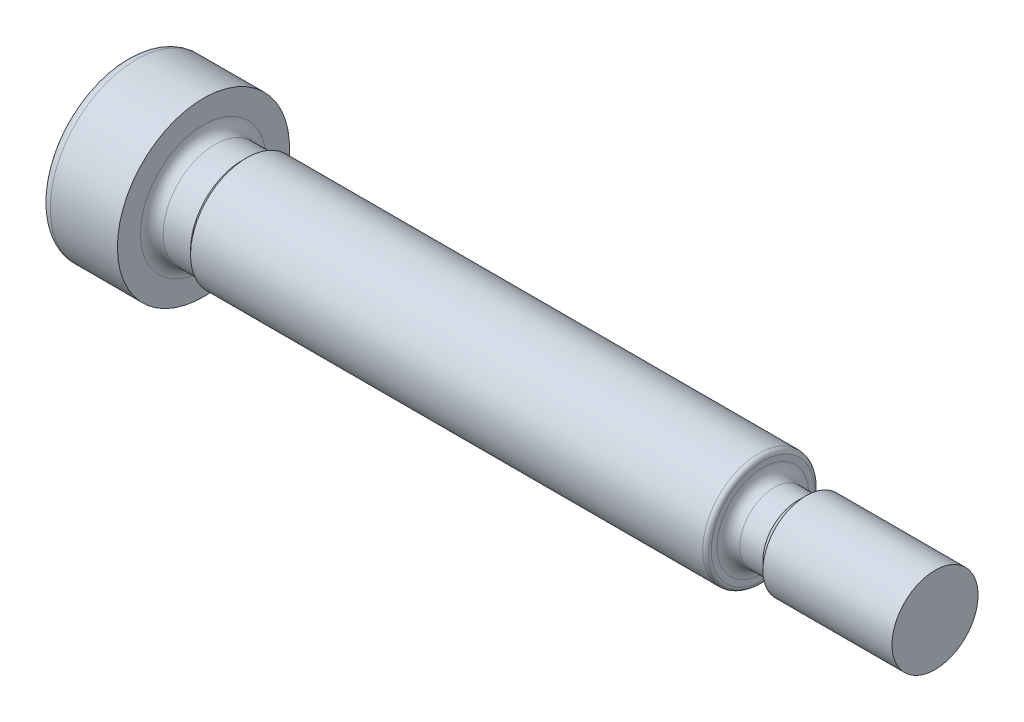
ISO-10303-21;
HEADER;
FILE_DESCRIPTION(('STEP AP214'),'2;1');
FILE_NAME('part.step','',(''),(''),'','','');
FILE_SCHEMA(('AUTOMOTIVE_DESIGN { 1 0 10303 214 1 1 1 1 }'));
ENDSEC;
DATA;
#1=APPLICATION_CONTEXT('core data for automotive mechanical design processes');
#2=APPLICATION_PROTOCOL_DEFINITION('international standard','automotive_design',2000,#1);
#3=PRODUCT_CONTEXT('',#1,'mechanical');
#4=PRODUCT('Part','Part','',(#3));
#5=PRODUCT_RELATED_PRODUCT_CATEGORY('part','',(#4));
#6=PRODUCT_DEFINITION_FORMATION('','',#4);
#7=PRODUCT_DEFINITION_CONTEXT('part definition',#1,'design');
#8=PRODUCT_DEFINITION('design','',#6,#7);
#9=PRODUCT_DEFINITION_SHAPE('','',#8);
#10=(LENGTH_UNIT() NAMED_UNIT(*) SI_UNIT(.MILLI.,.METRE.));
#11=(NAMED_UNIT(*) PLANE_ANGLE_UNIT() SI_UNIT($,.RADIAN.));
#12=(NAMED_UNIT(*) SI_UNIT($,.STERADIAN.) SOLID_ANGLE_UNIT());
#13=UNCERTAINTY_MEASURE_WITH_UNIT(LENGTH_MEASURE(1.E-05),#10,'distance_accuracy_value','');
#14=(GEOMETRIC_REPRESENTATION_CONTEXT(3) GLOBAL_UNCERTAINTY_ASSIGNED_CONTEXT((#13)) GLOBAL_UNIT_ASSIGNED_CONTEXT((#10,
#11,#12)) REPRESENTATION_CONTEXT('',''));
#15=CARTESIAN_POINT('',(0.,0.,0.));
#16=DIRECTION('',(0.,0.,1.));
#17=DIRECTION('',(1.,0.,0.));
#18=AXIS2_PLACEMENT_3D('',#15,#16,#17);
#19=CARTESIAN_POINT('',(0.,0.,0.));
#20=DIRECTION('',(1.,0.,0.));
#21=DIRECTION('',(0.,0.,-1.));
#22=AXIS2_PLACEMENT_3D('',#19,#20,#21);
#23=PLANE('',#22);
#24=DIRECTION('',(0.,-0.866025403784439,0.5));
#25=VECTOR('',#24,1.);
#26=CARTESIAN_POINT('',(0.,0.,-1.73205080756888));
#27=LINE('',#26,#25);
#28=CARTESIAN_POINT('',(0.,0.,-1.73205080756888));
#29=VERTEX_POINT('',#28);
#30=CARTESIAN_POINT('',(0.,-1.5,-0.86602540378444));
#31=VERTEX_POINT('',#30);
#32=EDGE_CURVE('E136',#29,#31,#27,.T.);
#33=ORIENTED_EDGE('',*,*,#32,.F.);
#34=DIRECTION('',(0.,-0.866025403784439,-0.5));
#35=VECTOR('',#34,1.);
#36=CARTESIAN_POINT('',(0.,1.5,-0.866025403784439));
#37=LINE('',#36,#35);
#38=CARTESIAN_POINT('',(0.,1.5,-0.866025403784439));
#39=VERTEX_POINT('',#38);
#40=EDGE_CURVE('E62',#39,#29,#37,.T.);
#41=ORIENTED_EDGE('',*,*,#40,.F.);
#42=DIRECTION('',(0.,0.,-1.));
#43=VECTOR('',#42,1.);
#44=CARTESIAN_POINT('',(0.,1.5,0.866025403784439));
#45=LINE('',#44,#43);
#46=CARTESIAN_POINT('',(0.,1.5,0.866025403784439));
#47=VERTEX_POINT('',#46);
#48=EDGE_CURVE('E145',#47,#39,#45,.T.);
#49=ORIENTED_EDGE('',*,*,#48,.F.);
#50=DIRECTION('',(0.,0.866025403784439,-0.5));
#51=VECTOR('',#50,1.);
#52=CARTESIAN_POINT('',(0.,0.,1.73205080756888));
#53=LINE('',#52,#51);
#54=CARTESIAN_POINT('',(0.,0.,1.73205080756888));
#55=VERTEX_POINT('',#54);
#56=EDGE_CURVE('E143',#55,#47,#53,.T.);
#57=ORIENTED_EDGE('',*,*,#56,.F.);
#58=DIRECTION('',(0.,0.866025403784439,0.5));
#59=VECTOR('',#58,1.);
#60=CARTESIAN_POINT('',(0.,-1.5,0.866025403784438));
#61=LINE('',#60,#59);
#62=CARTESIAN_POINT('',(0.,-1.5,0.866025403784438));
#63=VERTEX_POINT('',#62);
#64=EDGE_CURVE('E110',#63,#55,#61,.T.);
#65=ORIENTED_EDGE('',*,*,#64,.F.);
#66=DIRECTION('',(0.,0.,1.));
#67=VECTOR('',#66,1.);
#68=CARTESIAN_POINT('',(0.,-1.5,-0.86602540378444));
#69=LINE('',#68,#67);
#70=EDGE_CURVE('E139',#31,#63,#69,.T.);
#71=ORIENTED_EDGE('',*,*,#70,.F.);
#72=EDGE_LOOP('',(#33,#41,#49,#57,#65,#71));
#73=FACE_BOUND('',#72,.T.);
#74=CARTESIAN_POINT('',(0.,0.,0.));
#75=DIRECTION('',(1.,0.,0.));
#76=DIRECTION('',(0.,0.,-1.));
#77=AXIS2_PLACEMENT_3D('',#74,#75,#76);
#78=CIRCLE('',#77,4.4);
#79=CARTESIAN_POINT('',(0.,0.,-4.4));
#80=VERTEX_POINT('',#79);
#81=EDGE_CURVE('E184',#80,#80,#78,.F.);
#82=ORIENTED_EDGE('',*,*,#81,.T.);
#83=EDGE_LOOP('',(#82));
#84=FACE_BOUND('',#83,.T.);
#85=ADVANCED_FACE('F47',(#73,#84),#23,.F.);
#86=CARTESIAN_POINT('',(0.,0.,0.));
#87=DIRECTION('',(-1.,0.,0.));
#88=DIRECTION('',(0.,0.,1.));
#89=AXIS2_PLACEMENT_3D('',#86,#87,#88);
#90=CYLINDRICAL_SURFACE('',#89,5.);
#91=CARTESIAN_POINT('',(0.6,0.,0.));
#92=DIRECTION('',(1.,0.,0.));
#93=DIRECTION('',(0.,0.,-1.));
#94=AXIS2_PLACEMENT_3D('',#91,#92,#93);
#95=CIRCLE('',#94,5.);
#96=CARTESIAN_POINT('',(0.6,0.,-5.));
#97=VERTEX_POINT('',#96);
#98=EDGE_CURVE('E187',#97,#97,#95,.T.);
#99=ORIENTED_EDGE('',*,*,#98,.T.);
#100=EDGE_LOOP('',(#99));
#101=FACE_BOUND('',#100,.T.);
#102=CARTESIAN_POINT('',(4.5,0.,0.));
#103=DIRECTION('',(-1.,0.,0.));
#104=DIRECTION('',(0.,0.,1.));
#105=AXIS2_PLACEMENT_3D('',#102,#103,#104);
#106=CIRCLE('',#105,5.);
#107=CARTESIAN_POINT('',(4.5,0.,5.));
#108=VERTEX_POINT('',#107);
#109=EDGE_CURVE('E169',#108,#108,#106,.T.);
#110=ORIENTED_EDGE('',*,*,#109,.T.);
#111=EDGE_LOOP('',(#110));
#112=FACE_BOUND('',#111,.T.);
#113=ADVANCED_FACE('F204',(#101,#112),#90,.T.);
#114=CARTESIAN_POINT('',(4.5,5.,0.));
#115=DIRECTION('',(-1.,0.,0.));
#116=DIRECTION('',(0.,0.,1.));
#117=AXIS2_PLACEMENT_3D('',#114,#115,#116);
#118=PLANE('',#117);
#119=CARTESIAN_POINT('',(4.5,0.,0.));
#120=DIRECTION('',(-1.,0.,0.));
#121=DIRECTION('',(0.,0.,1.));
#122=AXIS2_PLACEMENT_3D('',#119,#120,#121);
#123=CIRCLE('',#122,3.66);
#124=CARTESIAN_POINT('',(4.5,0.,3.66));
#125=VERTEX_POINT('',#124);
#126=EDGE_CURVE('E172',#125,#125,#123,.T.);
#127=ORIENTED_EDGE('',*,*,#126,.T.);
#128=EDGE_LOOP('',(#127));
#129=FACE_BOUND('',#128,.T.);
#130=ORIENTED_EDGE('',*,*,#109,.F.);
#131=EDGE_LOOP('',(#130));
#132=FACE_BOUND('',#131,.T.);
#133=ADVANCED_FACE('F210',(#129,#132),#118,.F.);
#134=CARTESIAN_POINT('',(0.,0.,0.));
#135=DIRECTION('',(-1.,0.,0.));
#136=DIRECTION('',(0.,0.,1.));
#137=AXIS2_PLACEMENT_3D('',#134,#135,#136);
#138=CYLINDRICAL_SURFACE('',#137,3.);
#139=CARTESIAN_POINT('',(5.16,0.,0.));
#140=DIRECTION('',(-1.,0.,0.));
#141=DIRECTION('',(0.,0.,1.));
#142=AXIS2_PLACEMENT_3D('',#139,#140,#141);
#143=CIRCLE('',#142,3.);
#144=CARTESIAN_POINT('',(5.16,0.,3.));
#145=VERTEX_POINT('',#144);
#146=EDGE_CURVE('E175',#145,#145,#143,.F.);
#147=ORIENTED_EDGE('',*,*,#146,.T.);
#148=EDGE_LOOP('',(#147));
#149=FACE_BOUND('',#148,.T.);
#150=CARTESIAN_POINT('',(6.75,0.,0.));
#151=DIRECTION('',(-1.,0.,0.));
#152=DIRECTION('',(0.,0.,1.));
#153=AXIS2_PLACEMENT_3D('',#150,#151,#152);
#154=CIRCLE('',#153,3.);
#155=CARTESIAN_POINT('',(6.75,0.,3.));
#156=VERTEX_POINT('',#155);
#157=EDGE_CURVE('E166',#156,#156,#154,.T.);
#158=ORIENTED_EDGE('',*,*,#157,.T.);
#159=EDGE_LOOP('',(#158));
#160=FACE_BOUND('',#159,.T.);
#161=ADVANCED_FACE('F241',(#149,#160),#138,.T.);
#162=CARTESIAN_POINT('',(7.,0.,0.));
#163=DIRECTION('',(1.,0.,0.));
#164=DIRECTION('',(0.,0.,-1.));
#165=AXIS2_PLACEMENT_3D('',#162,#163,#164);
#166=CONICAL_SURFACE('',#165,3.25,0.785398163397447);
#167=ORIENTED_EDGE('',*,*,#157,.F.);
#168=EDGE_LOOP('',(#167));
#169=FACE_BOUND('',#168,.T.);
#170=CARTESIAN_POINT('',(7.,0.,0.));
#171=DIRECTION('',(-1.,0.,0.));
#172=DIRECTION('',(0.,0.,1.));
#173=AXIS2_PLACEMENT_3D('',#170,#171,#172);
#174=CIRCLE('',#173,3.25);
#175=CARTESIAN_POINT('',(7.,0.,3.25));
#176=VERTEX_POINT('',#175);
#177=EDGE_CURVE('E163',#176,#176,#174,.T.);
#178=ORIENTED_EDGE('',*,*,#177,.T.);
#179=EDGE_LOOP('',(#178));
#180=FACE_BOUND('',#179,.T.);
#181=ADVANCED_FACE('F246',(#169,#180),#166,.T.);
#182=CARTESIAN_POINT('',(0.,0.,0.));
#183=DIRECTION('',(-1.,0.,0.));
#184=DIRECTION('',(0.,0.,1.));
#185=AXIS2_PLACEMENT_3D('',#182,#183,#184);
#186=CYLINDRICAL_SURFACE('',#185,3.25);
#187=CARTESIAN_POINT('',(36.75,0.,0.));
#188=DIRECTION('',(-1.,0.,0.));
#189=DIRECTION('',(0.,0.,1.));
#190=AXIS2_PLACEMENT_3D('',#187,#188,#189);
#191=CIRCLE('',#190,3.25);
#192=CARTESIAN_POINT('',(36.75,0.,3.25));
#193=VERTEX_POINT('',#192);
#194=EDGE_CURVE('E55',#193,#193,#191,.T.);
#195=ORIENTED_EDGE('',*,*,#194,.T.);
#196=EDGE_LOOP('',(#195));
#197=FACE_BOUND('',#196,.T.);
#198=ORIENTED_EDGE('',*,*,#177,.F.);
#199=EDGE_LOOP('',(#198));
#200=FACE_BOUND('',#199,.T.);
#201=ADVANCED_FACE('F192',(#197,#200),#186,.T.);
#202=CARTESIAN_POINT('',(37.,3.25,0.));
#203=DIRECTION('',(-1.,0.,0.));
#204=DIRECTION('',(0.,0.,1.));
#205=AXIS2_PLACEMENT_3D('',#202,#203,#204);
#206=PLANE('',#205);
#207=CARTESIAN_POINT('',(37.,0.,0.));
#208=DIRECTION('',(-1.,0.,0.));
#209=DIRECTION('',(0.,0.,1.));
#210=AXIS2_PLACEMENT_3D('',#207,#208,#209);
#211=CIRCLE('',#210,3.);
#212=CARTESIAN_POINT('',(37.,0.,3.));
#213=VERTEX_POINT('',#212);
#214=EDGE_CURVE('E13',#213,#213,#211,.F.);
#215=ORIENTED_EDGE('',*,*,#214,.T.);
#216=EDGE_LOOP('',(#215));
#217=FACE_BOUND('',#216,.T.);
#218=CARTESIAN_POINT('',(37.,0.,0.));
#219=DIRECTION('',(-1.,0.,0.));
#220=DIRECTION('',(0.,0.,1.));
#221=AXIS2_PLACEMENT_3D('',#218,#219,#220);
#222=CIRCLE('',#221,2.66);
#223=CARTESIAN_POINT('',(37.,0.,2.66));
#224=VERTEX_POINT('',#223);
#225=EDGE_CURVE('E178',#224,#224,#222,.T.);
#226=ORIENTED_EDGE('',*,*,#225,.T.);
#227=EDGE_LOOP('',(#226));
#228=FACE_BOUND('',#227,.T.);
#229=ADVANCED_FACE('F255',(#217,#228),#206,.F.);
#230=CARTESIAN_POINT('',(0.,0.,0.));
#231=DIRECTION('',(-1.,0.,0.));
#232=DIRECTION('',(0.,0.,1.));
#233=AXIS2_PLACEMENT_3D('',#230,#231,#232);
#234=CYLINDRICAL_SURFACE('',#233,2.);
#235=CARTESIAN_POINT('',(37.66,0.,0.));
#236=DIRECTION('',(-1.,0.,0.));
#237=DIRECTION('',(0.,0.,1.));
#238=AXIS2_PLACEMENT_3D('',#235,#236,#237);
#239=CIRCLE('',#238,2.);
#240=CARTESIAN_POINT('',(37.66,0.,2.));
#241=VERTEX_POINT('',#240);
#242=EDGE_CURVE('E181',#241,#241,#239,.F.);
#243=ORIENTED_EDGE('',*,*,#242,.T.);
#244=EDGE_LOOP('',(#243));
#245=FACE_BOUND('',#244,.T.);
#246=CARTESIAN_POINT('',(39.,0.,0.));
#247=DIRECTION('',(-1.,0.,0.));
#248=DIRECTION('',(0.,0.,1.));
#249=AXIS2_PLACEMENT_3D('',#246,#247,#248);
#250=CIRCLE('',#249,2.);
#251=CARTESIAN_POINT('',(39.,0.,2.));
#252=VERTEX_POINT('',#251);
#253=EDGE_CURVE('E160',#252,#252,#250,.T.);
#254=ORIENTED_EDGE('',*,*,#253,.T.);
#255=EDGE_LOOP('',(#254));
#256=FACE_BOUND('',#255,.T.);
#257=ADVANCED_FACE('F258',(#245,#256),#234,.T.);
#258=CARTESIAN_POINT('',(39.5,0.,0.));
#259=DIRECTION('',(1.,0.,0.));
#260=DIRECTION('',(0.,0.,-1.));
#261=AXIS2_PLACEMENT_3D('',#258,#259,#260);
#262=CONICAL_SURFACE('',#261,2.5,0.785398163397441);
#263=ORIENTED_EDGE('',*,*,#253,.F.);
#264=EDGE_LOOP('',(#263));
#265=FACE_BOUND('',#264,.T.);
#266=CARTESIAN_POINT('',(39.5,0.,0.));
#267=DIRECTION('',(-1.,0.,0.));
#268=DIRECTION('',(0.,0.,1.));
#269=AXIS2_PLACEMENT_3D('',#266,#267,#268);
#270=CIRCLE('',#269,2.5);
#271=CARTESIAN_POINT('',(39.5,0.,2.5));
#272=VERTEX_POINT('',#271);
#273=EDGE_CURVE('E157',#272,#272,#270,.T.);
#274=ORIENTED_EDGE('',*,*,#273,.T.);
#275=EDGE_LOOP('',(#274));
#276=FACE_BOUND('',#275,.T.);
#277=ADVANCED_FACE('F262',(#265,#276),#262,.T.);
#278=CARTESIAN_POINT('',(0.,0.,0.));
#279=DIRECTION('',(-1.,0.,0.));
#280=DIRECTION('',(0.,0.,1.));
#281=AXIS2_PLACEMENT_3D('',#278,#279,#280);
#282=CYLINDRICAL_SURFACE('',#281,2.5);
#283=ORIENTED_EDGE('',*,*,#273,.F.);
#284=EDGE_LOOP('',(#283));
#285=FACE_BOUND('',#284,.T.);
#286=CARTESIAN_POINT('',(47.,0.,0.));
#287=DIRECTION('',(-1.,0.,0.));
#288=DIRECTION('',(0.,0.,1.));
#289=AXIS2_PLACEMENT_3D('',#286,#287,#288);
#290=CIRCLE('',#289,2.5);
#291=CARTESIAN_POINT('',(47.,0.,2.5));
#292=VERTEX_POINT('',#291);
#293=EDGE_CURVE('E149',#292,#292,#290,.T.);
#294=ORIENTED_EDGE('',*,*,#293,.T.);
#295=EDGE_LOOP('',(#294));
#296=FACE_BOUND('',#295,.T.);
#297=ADVANCED_FACE('F266',(#285,#296),#282,.T.);
#298=CARTESIAN_POINT('',(47.,2.5,0.));
#299=DIRECTION('',(-1.,0.,0.));
#300=DIRECTION('',(0.,0.,1.));
#301=AXIS2_PLACEMENT_3D('',#298,#299,#300);
#302=PLANE('',#301);
#303=ORIENTED_EDGE('',*,*,#293,.F.);
#304=EDGE_LOOP('',(#303));
#305=FACE_BOUND('',#304,.T.);
#306=ADVANCED_FACE('F221',(#305),#302,.F.);
#307=CARTESIAN_POINT('',(5.16,0.,0.));
#308=DIRECTION('',(-1.,0.,0.));
#309=DIRECTION('',(0.,0.,1.));
#310=AXIS2_PLACEMENT_3D('',#307,#308,#309);
#311=TOROIDAL_SURFACE('',#310,3.66,0.66);
#312=ORIENTED_EDGE('',*,*,#146,.F.);
#313=EDGE_LOOP('',(#312));
#314=FACE_BOUND('',#313,.T.);
#315=ORIENTED_EDGE('',*,*,#126,.F.);
#316=EDGE_LOOP('',(#315));
#317=FACE_BOUND('',#316,.T.);
#318=ADVANCED_FACE('F217',(#314,#317),#311,.F.);
#319=CARTESIAN_POINT('',(37.66,0.,0.));
#320=DIRECTION('',(-1.,0.,0.));
#321=DIRECTION('',(0.,0.,1.));
#322=AXIS2_PLACEMENT_3D('',#319,#320,#321);
#323=TOROIDAL_SURFACE('',#322,2.66,0.66);
#324=ORIENTED_EDGE('',*,*,#242,.F.);
#325=EDGE_LOOP('',(#324));
#326=FACE_BOUND('',#325,.T.);
#327=ORIENTED_EDGE('',*,*,#225,.F.);
#328=EDGE_LOOP('',(#327));
#329=FACE_BOUND('',#328,.T.);
#330=ADVANCED_FACE('F220',(#326,#329),#323,.F.);
#331=CARTESIAN_POINT('',(0.6,0.,0.));
#332=DIRECTION('',(1.,0.,0.));
#333=DIRECTION('',(0.,0.,-1.));
#334=AXIS2_PLACEMENT_3D('',#331,#332,#333);
#335=TOROIDAL_SURFACE('',#334,4.4,0.6);
#336=ORIENTED_EDGE('',*,*,#98,.F.);
#337=EDGE_LOOP('',(#336));
#338=FACE_BOUND('',#337,.T.);
#339=ORIENTED_EDGE('',*,*,#81,.F.);
#340=EDGE_LOOP('',(#339));
#341=FACE_BOUND('',#340,.T.);
#342=ADVANCED_FACE('F224',(#338,#341),#335,.T.);
#343=CARTESIAN_POINT('',(3.5,1.5,-0.866025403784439));
#344=DIRECTION('',(0.,0.5,-0.866025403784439));
#345=DIRECTION('',(0.,0.866025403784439,0.5));
#346=AXIS2_PLACEMENT_3D('',#343,#344,#345);
#347=PLANE('',#346);
#348=ORIENTED_EDGE('',*,*,#40,.T.);
#349=DIRECTION('',(-1.,0.,0.));
#350=VECTOR('',#349,1.);
#351=CARTESIAN_POINT('',(3.5,0.,-1.73205080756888));
#352=LINE('',#351,#350);
#353=CARTESIAN_POINT('',(3.5,0.,-1.73205080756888));
#354=VERTEX_POINT('',#353);
#355=EDGE_CURVE('E92',#354,#29,#352,.T.);
#356=ORIENTED_EDGE('',*,*,#355,.F.);
#357=DIRECTION('',(0.,-0.866025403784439,-0.5));
#358=VECTOR('',#357,1.);
#359=CARTESIAN_POINT('',(3.5,1.5,-0.866025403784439));
#360=LINE('',#359,#358);
#361=CARTESIAN_POINT('',(3.5,1.5,-0.866025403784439));
#362=VERTEX_POINT('',#361);
#363=EDGE_CURVE('E147',#362,#354,#360,.T.);
#364=ORIENTED_EDGE('',*,*,#363,.F.);
#365=DIRECTION('',(-1.,0.,0.));
#366=VECTOR('',#365,1.);
#367=CARTESIAN_POINT('',(3.5,1.5,-0.866025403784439));
#368=LINE('',#367,#366);
#369=EDGE_CURVE('E70',#362,#39,#368,.T.);
#370=ORIENTED_EDGE('',*,*,#369,.T.);
#371=EDGE_LOOP('',(#348,#356,#364,#370));
#372=FACE_BOUND('',#371,.T.);
#373=ADVANCED_FACE('F227',(#372),#347,.F.);
#374=CARTESIAN_POINT('',(3.5,1.5,0.866025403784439));
#375=DIRECTION('',(0.,1.,0.));
#376=DIRECTION('',(0.,0.,1.));
#377=AXIS2_PLACEMENT_3D('',#374,#375,#376);
#378=PLANE('',#377);
#379=ORIENTED_EDGE('',*,*,#48,.T.);
#380=ORIENTED_EDGE('',*,*,#369,.F.);
#381=DIRECTION('',(0.,0.,-1.));
#382=VECTOR('',#381,1.);
#383=CARTESIAN_POINT('',(3.5,1.5,0.866025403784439));
#384=LINE('',#383,#382);
#385=CARTESIAN_POINT('',(3.5,1.5,0.866025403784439));
#386=VERTEX_POINT('',#385);
#387=EDGE_CURVE('E122',#386,#362,#384,.T.);
#388=ORIENTED_EDGE('',*,*,#387,.F.);
#389=DIRECTION('',(-1.,0.,0.));
#390=VECTOR('',#389,1.);
#391=CARTESIAN_POINT('',(3.5,1.5,0.866025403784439));
#392=LINE('',#391,#390);
#393=EDGE_CURVE('E114',#386,#47,#392,.T.);
#394=ORIENTED_EDGE('',*,*,#393,.T.);
#395=EDGE_LOOP('',(#379,#380,#388,#394));
#396=FACE_BOUND('',#395,.T.);
#397=ADVANCED_FACE('F232',(#396),#378,.F.);
#398=CARTESIAN_POINT('',(3.5,0.,1.73205080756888));
#399=DIRECTION('',(0.,0.5,0.866025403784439));
#400=DIRECTION('',(0.,-0.866025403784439,0.5));
#401=AXIS2_PLACEMENT_3D('',#398,#399,#400);
#402=PLANE('',#401);
#403=ORIENTED_EDGE('',*,*,#56,.T.);
#404=ORIENTED_EDGE('',*,*,#393,.F.);
#405=DIRECTION('',(0.,0.866025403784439,-0.5));
#406=VECTOR('',#405,1.);
#407=CARTESIAN_POINT('',(3.5,0.,1.73205080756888));
#408=LINE('',#407,#406);
#409=CARTESIAN_POINT('',(3.5,0.,1.73205080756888));
#410=VERTEX_POINT('',#409);
#411=EDGE_CURVE('E118',#410,#386,#408,.T.);
#412=ORIENTED_EDGE('',*,*,#411,.F.);
#413=DIRECTION('',(-1.,0.,0.));
#414=VECTOR('',#413,1.);
#415=CARTESIAN_POINT('',(3.5,0.,1.73205080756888));
#416=LINE('',#415,#414);
#417=EDGE_CURVE('E103',#410,#55,#416,.T.);
#418=ORIENTED_EDGE('',*,*,#417,.T.);
#419=EDGE_LOOP('',(#403,#404,#412,#418));
#420=FACE_BOUND('',#419,.T.);
#421=ADVANCED_FACE('F119',(#420),#402,.F.);
#422=CARTESIAN_POINT('',(3.5,-1.5,0.866025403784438));
#423=DIRECTION('',(0.,-0.5,0.866025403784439));
#424=DIRECTION('',(0.,-0.866025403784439,-0.5));
#425=AXIS2_PLACEMENT_3D('',#422,#423,#424);
#426=PLANE('',#425);
#427=ORIENTED_EDGE('',*,*,#64,.T.);
#428=ORIENTED_EDGE('',*,*,#417,.F.);
#429=DIRECTION('',(0.,0.866025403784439,0.5));
#430=VECTOR('',#429,1.);
#431=CARTESIAN_POINT('',(3.5,-1.5,0.866025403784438));
#432=LINE('',#431,#430);
#433=CARTESIAN_POINT('',(3.5,-1.5,0.866025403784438));
#434=VERTEX_POINT('',#433);
#435=EDGE_CURVE('E107',#434,#410,#432,.T.);
#436=ORIENTED_EDGE('',*,*,#435,.F.);
#437=DIRECTION('',(-1.,0.,0.));
#438=VECTOR('',#437,1.);
#439=CARTESIAN_POINT('',(3.5,-1.5,0.866025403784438));
#440=LINE('',#439,#438);
#441=EDGE_CURVE('E115',#434,#63,#440,.T.);
#442=ORIENTED_EDGE('',*,*,#441,.T.);
#443=EDGE_LOOP('',(#427,#428,#436,#442));
#444=FACE_BOUND('',#443,.T.);
#445=ADVANCED_FACE('F105',(#444),#426,.F.);
#446=CARTESIAN_POINT('',(3.5,-1.5,-0.86602540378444));
#447=DIRECTION('',(0.,-1.,0.));
#448=DIRECTION('',(0.,0.,-1.));
#449=AXIS2_PLACEMENT_3D('',#446,#447,#448);
#450=PLANE('',#449);
#451=ORIENTED_EDGE('',*,*,#70,.T.);
#452=ORIENTED_EDGE('',*,*,#441,.F.);
#453=DIRECTION('',(0.,0.,1.));
#454=VECTOR('',#453,1.);
#455=CARTESIAN_POINT('',(3.5,-1.5,-0.86602540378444));
#456=LINE('',#455,#454);
#457=CARTESIAN_POINT('',(3.5,-1.5,-0.86602540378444));
#458=VERTEX_POINT('',#457);
#459=EDGE_CURVE('E128',#458,#434,#456,.T.);
#460=ORIENTED_EDGE('',*,*,#459,.F.);
#461=DIRECTION('',(-1.,0.,0.));
#462=VECTOR('',#461,1.);
#463=CARTESIAN_POINT('',(3.5,-1.5,-0.86602540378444));
#464=LINE('',#463,#462);
#465=EDGE_CURVE('E152',#458,#31,#464,.T.);
#466=ORIENTED_EDGE('',*,*,#465,.T.);
#467=EDGE_LOOP('',(#451,#452,#460,#466));
#468=FACE_BOUND('',#467,.T.);
#469=ADVANCED_FACE('F276',(#468),#450,.F.);
#470=CARTESIAN_POINT('',(3.5,0.,-1.73205080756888));
#471=DIRECTION('',(0.,-0.5,-0.866025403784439));
#472=DIRECTION('',(0.,0.866025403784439,-0.5));
#473=AXIS2_PLACEMENT_3D('',#470,#471,#472);
#474=PLANE('',#473);
#475=ORIENTED_EDGE('',*,*,#32,.T.);
#476=ORIENTED_EDGE('',*,*,#465,.F.);
#477=DIRECTION('',(0.,-0.866025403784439,0.5));
#478=VECTOR('',#477,1.);
#479=CARTESIAN_POINT('',(3.5,0.,-1.73205080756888));
#480=LINE('',#479,#478);
#481=EDGE_CURVE('E130',#354,#458,#480,.T.);
#482=ORIENTED_EDGE('',*,*,#481,.F.);
#483=ORIENTED_EDGE('',*,*,#355,.T.);
#484=EDGE_LOOP('',(#475,#476,#482,#483));
#485=FACE_BOUND('',#484,.T.);
#486=ADVANCED_FACE('F200',(#485),#474,.F.);
#487=CARTESIAN_POINT('',(3.5,0.,0.));
#488=DIRECTION('',(-1.,0.,0.));
#489=DIRECTION('',(0.,0.,1.));
#490=AXIS2_PLACEMENT_3D('',#487,#488,#489);
#491=PLANE('',#490);
#492=ORIENTED_EDGE('',*,*,#363,.T.);
#493=ORIENTED_EDGE('',*,*,#481,.T.);
#494=ORIENTED_EDGE('',*,*,#459,.T.);
#495=ORIENTED_EDGE('',*,*,#435,.T.);
#496=ORIENTED_EDGE('',*,*,#411,.T.);
#497=ORIENTED_EDGE('',*,*,#387,.T.);
#498=EDGE_LOOP('',(#492,#493,#494,#495,#496,#497));
#499=FACE_BOUND('',#498,.T.);
#500=ADVANCED_FACE('F125',(#499),#491,.T.);
#501=CARTESIAN_POINT('',(36.75,0.,0.));
#502=DIRECTION('',(-1.,0.,0.));
#503=DIRECTION('',(0.,0.,1.));
#504=AXIS2_PLACEMENT_3D('',#501,#502,#503);
#505=TOROIDAL_SURFACE('',#504,3.,0.25);
#506=ORIENTED_EDGE('',*,*,#214,.F.);
#507=EDGE_LOOP('',(#506));
#508=FACE_BOUND('',#507,.T.);
#509=ORIENTED_EDGE('',*,*,#194,.F.);
#510=EDGE_LOOP('',(#509));
#511=FACE_BOUND('',#510,.T.);
#512=ADVANCED_FACE('F49',(#508,#511),#505,.T.);
#513=CLOSED_SHELL('',(#85,#113,#133,#161,#181,#201,#229,#257,#277,#297,#306,#318,#330,#342,#373,
#397,#421,#445,#469,#486,#500,#512));
#514=MANIFOLD_SOLID_BREP('B2',#513);
#515=ADVANCED_BREP_SHAPE_REPRESENTATION('',(#18,#514),#14);
#516=SHAPE_DEFINITION_REPRESENTATION(#9,#515);
ENDSEC;
END-ISO-10303-21;
